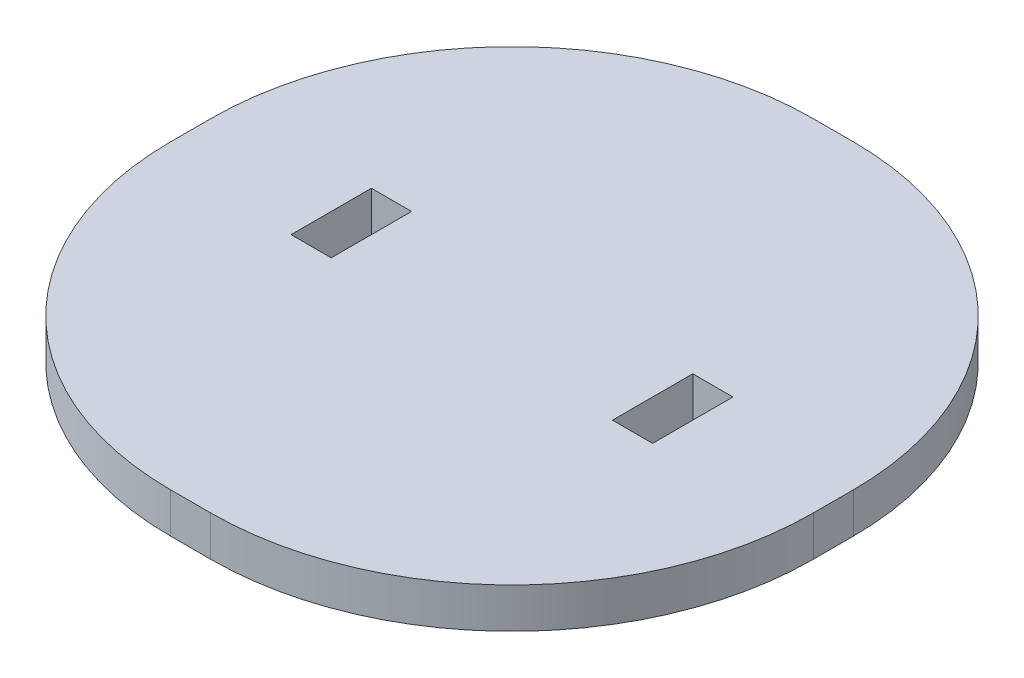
ISO-10303-21;
HEADER;
FILE_DESCRIPTION(('STEP AP214'),'2;1');
FILE_NAME('part.step','',(''),(''),'','','');
FILE_SCHEMA(('AUTOMOTIVE_DESIGN { 1 0 10303 214 1 1 1 1 }'));
ENDSEC;
DATA;
#1=APPLICATION_CONTEXT('core data for automotive mechanical design processes');
#2=APPLICATION_PROTOCOL_DEFINITION('international standard','automotive_design',2000,#1);
#3=PRODUCT_CONTEXT('',#1,'mechanical');
#4=PRODUCT('Part','Part','',(#3));
#5=PRODUCT_RELATED_PRODUCT_CATEGORY('part','',(#4));
#6=PRODUCT_DEFINITION_FORMATION('','',#4);
#7=PRODUCT_DEFINITION_CONTEXT('part definition',#1,'design');
#8=PRODUCT_DEFINITION('design','',#6,#7);
#9=PRODUCT_DEFINITION_SHAPE('','',#8);
#10=(LENGTH_UNIT() NAMED_UNIT(*) SI_UNIT(.MILLI.,.METRE.));
#11=(NAMED_UNIT(*) PLANE_ANGLE_UNIT() SI_UNIT($,.RADIAN.));
#12=(NAMED_UNIT(*) SI_UNIT($,.STERADIAN.) SOLID_ANGLE_UNIT());
#13=UNCERTAINTY_MEASURE_WITH_UNIT(LENGTH_MEASURE(1.E-05),#10,'distance_accuracy_value','');
#14=(GEOMETRIC_REPRESENTATION_CONTEXT(3) GLOBAL_UNCERTAINTY_ASSIGNED_CONTEXT((#13)) GLOBAL_UNIT_ASSIGNED_CONTEXT((#10,
#11,#12)) REPRESENTATION_CONTEXT('',''));
#15=CARTESIAN_POINT('',(0.,0.,0.));
#16=DIRECTION('',(0.,0.,1.));
#17=DIRECTION('',(1.,0.,0.));
#18=AXIS2_PLACEMENT_3D('',#15,#16,#17);
#19=CARTESIAN_POINT('',(25.4,1.5875,-25.4));
#20=DIRECTION('',(-1.,0.,0.));
#21=DIRECTION('',(0.,0.,1.));
#22=AXIS2_PLACEMENT_3D('',#19,#20,#21);
#23=PLANE('',#22);
#24=DIRECTION('',(0.,0.,-1.));
#25=VECTOR('',#24,1.);
#26=CARTESIAN_POINT('',(25.4,-1.5875,-25.4));
#27=LINE('',#26,#25);
#28=CARTESIAN_POINT('',(25.4,-1.5875,1.5875));
#29=VERTEX_POINT('',#28);
#30=CARTESIAN_POINT('',(25.4,-1.5875,-1.5875));
#31=VERTEX_POINT('',#30);
#32=EDGE_CURVE('E214',#29,#31,#27,.T.);
#33=ORIENTED_EDGE('',*,*,#32,.T.);
#34=DIRECTION('',(0.,-1.,0.));
#35=VECTOR('',#34,1.);
#36=CARTESIAN_POINT('',(25.4,1.5875,-1.5875));
#37=LINE('',#36,#35);
#38=CARTESIAN_POINT('',(25.4,1.5875,-1.5875));
#39=VERTEX_POINT('',#38);
#40=EDGE_CURVE('E257',#31,#39,#37,.F.);
#41=ORIENTED_EDGE('',*,*,#40,.T.);
#42=DIRECTION('',(0.,0.,-1.));
#43=VECTOR('',#42,1.);
#44=CARTESIAN_POINT('',(25.4,1.5875,-25.4));
#45=LINE('',#44,#43);
#46=CARTESIAN_POINT('',(25.4,1.5875,1.5875));
#47=VERTEX_POINT('',#46);
#48=EDGE_CURVE('E221',#47,#39,#45,.T.);
#49=ORIENTED_EDGE('',*,*,#48,.F.);
#50=DIRECTION('',(0.,-1.,0.));
#51=VECTOR('',#50,1.);
#52=CARTESIAN_POINT('',(25.4,1.5875,1.5875));
#53=LINE('',#52,#51);
#54=EDGE_CURVE('E254',#47,#29,#53,.T.);
#55=ORIENTED_EDGE('',*,*,#54,.T.);
#56=EDGE_LOOP('',(#33,#41,#49,#55));
#57=FACE_BOUND('',#56,.T.);
#58=ADVANCED_FACE('F31',(#57),#23,.F.);
#59=CARTESIAN_POINT('',(-25.4,1.5875,-25.4));
#60=DIRECTION('',(0.,0.,1.));
#61=DIRECTION('',(1.,0.,0.));
#62=AXIS2_PLACEMENT_3D('',#59,#60,#61);
#63=PLANE('',#62);
#64=DIRECTION('',(-1.,0.,0.));
#65=VECTOR('',#64,1.);
#66=CARTESIAN_POINT('',(-25.4,1.5875,-25.4));
#67=LINE('',#66,#65);
#68=CARTESIAN_POINT('',(1.5875,1.5875,-25.4));
#69=VERTEX_POINT('',#68);
#70=CARTESIAN_POINT('',(-1.5875,1.5875,-25.4));
#71=VERTEX_POINT('',#70);
#72=EDGE_CURVE('E224',#69,#71,#67,.T.);
#73=ORIENTED_EDGE('',*,*,#72,.F.);
#74=DIRECTION('',(0.,-1.,0.));
#75=VECTOR('',#74,1.);
#76=CARTESIAN_POINT('',(1.5875,1.5875,-25.4));
#77=LINE('',#76,#75);
#78=CARTESIAN_POINT('',(1.5875,-1.5875,-25.4));
#79=VERTEX_POINT('',#78);
#80=EDGE_CURVE('E243',#69,#79,#77,.T.);
#81=ORIENTED_EDGE('',*,*,#80,.T.);
#82=DIRECTION('',(-1.,0.,0.));
#83=VECTOR('',#82,1.);
#84=CARTESIAN_POINT('',(-25.4,-1.5875,-25.4));
#85=LINE('',#84,#83);
#86=CARTESIAN_POINT('',(-1.5875,-1.5875,-25.4));
#87=VERTEX_POINT('',#86);
#88=EDGE_CURVE('E235',#79,#87,#85,.T.);
#89=ORIENTED_EDGE('',*,*,#88,.T.);
#90=DIRECTION('',(0.,-1.,0.));
#91=VECTOR('',#90,1.);
#92=CARTESIAN_POINT('',(-1.5875,1.5875,-25.4));
#93=LINE('',#92,#91);
#94=EDGE_CURVE('E232',#87,#71,#93,.F.);
#95=ORIENTED_EDGE('',*,*,#94,.T.);
#96=EDGE_LOOP('',(#73,#81,#89,#95));
#97=FACE_BOUND('',#96,.T.);
#98=ADVANCED_FACE('F300',(#97),#63,.F.);
#99=CARTESIAN_POINT('',(-25.4,1.5875,-25.4));
#100=DIRECTION('',(1.,0.,0.));
#101=DIRECTION('',(0.,0.,-1.));
#102=AXIS2_PLACEMENT_3D('',#99,#100,#101);
#103=PLANE('',#102);
#104=DIRECTION('',(0.,0.,1.));
#105=VECTOR('',#104,1.);
#106=CARTESIAN_POINT('',(-25.4,-1.5875,-25.4));
#107=LINE('',#106,#105);
#108=CARTESIAN_POINT('',(-25.4,-1.5875,-1.5875));
#109=VERTEX_POINT('',#108);
#110=CARTESIAN_POINT('',(-25.4,-1.5875,1.5875));
#111=VERTEX_POINT('',#110);
#112=EDGE_CURVE('E238',#109,#111,#107,.T.);
#113=ORIENTED_EDGE('',*,*,#112,.T.);
#114=DIRECTION('',(0.,-1.,0.));
#115=VECTOR('',#114,1.);
#116=CARTESIAN_POINT('',(-25.4,1.5875,1.5875));
#117=LINE('',#116,#115);
#118=CARTESIAN_POINT('',(-25.4,1.5875,1.5875));
#119=VERTEX_POINT('',#118);
#120=EDGE_CURVE('E11',#111,#119,#117,.F.);
#121=ORIENTED_EDGE('',*,*,#120,.T.);
#122=DIRECTION('',(0.,0.,1.));
#123=VECTOR('',#122,1.);
#124=CARTESIAN_POINT('',(-25.4,1.5875,-25.4));
#125=LINE('',#124,#123);
#126=CARTESIAN_POINT('',(-25.4,1.5875,-1.5875));
#127=VERTEX_POINT('',#126);
#128=EDGE_CURVE('E228',#127,#119,#125,.T.);
#129=ORIENTED_EDGE('',*,*,#128,.F.);
#130=DIRECTION('',(0.,-1.,0.));
#131=VECTOR('',#130,1.);
#132=CARTESIAN_POINT('',(-25.4,1.5875,-1.5875));
#133=LINE('',#132,#131);
#134=EDGE_CURVE('E39',#127,#109,#133,.T.);
#135=ORIENTED_EDGE('',*,*,#134,.T.);
#136=EDGE_LOOP('',(#113,#121,#129,#135));
#137=FACE_BOUND('',#136,.T.);
#138=ADVANCED_FACE('F274',(#137),#103,.F.);
#139=CARTESIAN_POINT('',(-25.4,1.5875,25.4));
#140=DIRECTION('',(0.,0.,-1.));
#141=DIRECTION('',(-1.,0.,0.));
#142=AXIS2_PLACEMENT_3D('',#139,#140,#141);
#143=PLANE('',#142);
#144=DIRECTION('',(1.,0.,0.));
#145=VECTOR('',#144,1.);
#146=CARTESIAN_POINT('',(-25.4,-1.5875,25.4));
#147=LINE('',#146,#145);
#148=CARTESIAN_POINT('',(-1.5875,-1.5875,25.4));
#149=VERTEX_POINT('',#148);
#150=CARTESIAN_POINT('',(1.5875,-1.5875,25.4));
#151=VERTEX_POINT('',#150);
#152=EDGE_CURVE('E225',#149,#151,#147,.T.);
#153=ORIENTED_EDGE('',*,*,#152,.T.);
#154=DIRECTION('',(0.,-1.,0.));
#155=VECTOR('',#154,1.);
#156=CARTESIAN_POINT('',(1.5875,1.5875,25.4));
#157=LINE('',#156,#155);
#158=CARTESIAN_POINT('',(1.5875,1.5875,25.4));
#159=VERTEX_POINT('',#158);
#160=EDGE_CURVE('E46',#151,#159,#157,.F.);
#161=ORIENTED_EDGE('',*,*,#160,.T.);
#162=DIRECTION('',(1.,0.,0.));
#163=VECTOR('',#162,1.);
#164=CARTESIAN_POINT('',(-25.4,1.5875,25.4));
#165=LINE('',#164,#163);
#166=CARTESIAN_POINT('',(-1.5875,1.5875,25.4));
#167=VERTEX_POINT('',#166);
#168=EDGE_CURVE('E230',#167,#159,#165,.T.);
#169=ORIENTED_EDGE('',*,*,#168,.F.);
#170=DIRECTION('',(0.,-1.,0.));
#171=VECTOR('',#170,1.);
#172=CARTESIAN_POINT('',(-1.5875,1.5875,25.4));
#173=LINE('',#172,#171);
#174=EDGE_CURVE('E266',#167,#149,#173,.T.);
#175=ORIENTED_EDGE('',*,*,#174,.T.);
#176=EDGE_LOOP('',(#153,#161,#169,#175));
#177=FACE_BOUND('',#176,.T.);
#178=ADVANCED_FACE('F284',(#177),#143,.F.);
#179=CARTESIAN_POINT('',(25.4,1.5875,25.4));
#180=DIRECTION('',(0.,1.,0.));
#181=DIRECTION('',(0.,0.,1.));
#182=AXIS2_PLACEMENT_3D('',#179,#180,#181);
#183=PLANE('',#182);
#184=DIRECTION('',(0.,0.,-1.));
#185=VECTOR('',#184,1.);
#186=CARTESIAN_POINT('',(14.2875,1.5875,-3.17499999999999));
#187=LINE('',#186,#185);
#188=CARTESIAN_POINT('',(14.2875,1.5875,3.17500000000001));
#189=VERTEX_POINT('',#188);
#190=CARTESIAN_POINT('',(14.2875,1.5875,-3.17499999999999));
#191=VERTEX_POINT('',#190);
#192=EDGE_CURVE('E152',#189,#191,#187,.T.);
#193=ORIENTED_EDGE('',*,*,#192,.F.);
#194=DIRECTION('',(1.,0.,0.));
#195=VECTOR('',#194,1.);
#196=CARTESIAN_POINT('',(14.2875,1.5875,3.17500000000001));
#197=LINE('',#196,#195);
#198=CARTESIAN_POINT('',(11.1125,1.5875,3.17500000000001));
#199=VERTEX_POINT('',#198);
#200=EDGE_CURVE('E170',#199,#189,#197,.T.);
#201=ORIENTED_EDGE('',*,*,#200,.F.);
#202=DIRECTION('',(0.,0.,1.));
#203=VECTOR('',#202,1.);
#204=CARTESIAN_POINT('',(11.1125,1.5875,-3.17499999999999));
#205=LINE('',#204,#203);
#206=CARTESIAN_POINT('',(11.1125,1.5875,-3.17499999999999));
#207=VERTEX_POINT('',#206);
#208=EDGE_CURVE('E173',#207,#199,#205,.T.);
#209=ORIENTED_EDGE('',*,*,#208,.F.);
#210=DIRECTION('',(-1.,0.,0.));
#211=VECTOR('',#210,1.);
#212=CARTESIAN_POINT('',(14.2875,1.5875,-3.17499999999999));
#213=LINE('',#212,#211);
#214=EDGE_CURVE('E179',#191,#207,#213,.T.);
#215=ORIENTED_EDGE('',*,*,#214,.F.);
#216=EDGE_LOOP('',(#193,#201,#209,#215));
#217=FACE_BOUND('',#216,.T.);
#218=DIRECTION('',(0.,0.,-1.));
#219=VECTOR('',#218,1.);
#220=CARTESIAN_POINT('',(-11.1125,1.5875,-3.17499999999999));
#221=LINE('',#220,#219);
#222=CARTESIAN_POINT('',(-11.1125,1.5875,3.17500000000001));
#223=VERTEX_POINT('',#222);
#224=CARTESIAN_POINT('',(-11.1125,1.5875,-3.17499999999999));
#225=VERTEX_POINT('',#224);
#226=EDGE_CURVE('E185',#223,#225,#221,.T.);
#227=ORIENTED_EDGE('',*,*,#226,.F.);
#228=DIRECTION('',(1.,0.,0.));
#229=VECTOR('',#228,1.);
#230=CARTESIAN_POINT('',(-14.2875,1.5875,3.17500000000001));
#231=LINE('',#230,#229);
#232=CARTESIAN_POINT('',(-14.2875,1.5875,3.17500000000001));
#233=VERTEX_POINT('',#232);
#234=EDGE_CURVE('E193',#233,#223,#231,.T.);
#235=ORIENTED_EDGE('',*,*,#234,.F.);
#236=DIRECTION('',(0.,0.,1.));
#237=VECTOR('',#236,1.);
#238=CARTESIAN_POINT('',(-14.2875,1.5875,-3.17499999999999));
#239=LINE('',#238,#237);
#240=CARTESIAN_POINT('',(-14.2875,1.5875,-3.17499999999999));
#241=VERTEX_POINT('',#240);
#242=EDGE_CURVE('E207',#241,#233,#239,.T.);
#243=ORIENTED_EDGE('',*,*,#242,.F.);
#244=DIRECTION('',(-1.,0.,0.));
#245=VECTOR('',#244,1.);
#246=CARTESIAN_POINT('',(-14.2875,1.5875,-3.17499999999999));
#247=LINE('',#246,#245);
#248=EDGE_CURVE('E204',#225,#241,#247,.T.);
#249=ORIENTED_EDGE('',*,*,#248,.F.);
#250=EDGE_LOOP('',(#227,#235,#243,#249));
#251=FACE_BOUND('',#250,.T.);
#252=ORIENTED_EDGE('',*,*,#48,.T.);
#253=CARTESIAN_POINT('',(1.5875,1.5875,-1.5875));
#254=DIRECTION('',(0.,1.,0.));
#255=DIRECTION('',(0.,0.,1.));
#256=AXIS2_PLACEMENT_3D('',#253,#254,#255);
#257=CIRCLE('',#256,23.8125);
#258=EDGE_CURVE('E264',#39,#69,#257,.T.);
#259=ORIENTED_EDGE('',*,*,#258,.T.);
#260=ORIENTED_EDGE('',*,*,#72,.T.);
#261=CARTESIAN_POINT('',(-1.5875,1.5875,-1.5875));
#262=DIRECTION('',(0.,1.,0.));
#263=DIRECTION('',(0.,0.,1.));
#264=AXIS2_PLACEMENT_3D('',#261,#262,#263);
#265=CIRCLE('',#264,23.8125);
#266=EDGE_CURVE('E259',#71,#127,#265,.T.);
#267=ORIENTED_EDGE('',*,*,#266,.T.);
#268=ORIENTED_EDGE('',*,*,#128,.T.);
#269=CARTESIAN_POINT('',(-1.5875,1.5875,1.5875));
#270=DIRECTION('',(0.,1.,0.));
#271=DIRECTION('',(0.,0.,1.));
#272=AXIS2_PLACEMENT_3D('',#269,#270,#271);
#273=CIRCLE('',#272,23.8125);
#274=EDGE_CURVE('E53',#119,#167,#273,.T.);
#275=ORIENTED_EDGE('',*,*,#274,.T.);
#276=ORIENTED_EDGE('',*,*,#168,.T.);
#277=CARTESIAN_POINT('',(1.5875,1.5875,1.5875));
#278=DIRECTION('',(0.,1.,0.));
#279=DIRECTION('',(0.,0.,1.));
#280=AXIS2_PLACEMENT_3D('',#277,#278,#279);
#281=CIRCLE('',#280,23.8125);
#282=EDGE_CURVE('E262',#159,#47,#281,.T.);
#283=ORIENTED_EDGE('',*,*,#282,.T.);
#284=EDGE_LOOP('',(#252,#259,#260,#267,#268,#275,#276,#283));
#285=FACE_BOUND('',#284,.T.);
#286=ADVANCED_FACE('F286',(#217,#251,#285),#183,.T.);
#287=CARTESIAN_POINT('',(25.4,-1.5875,25.4));
#288=DIRECTION('',(0.,1.,0.));
#289=DIRECTION('',(0.,0.,1.));
#290=AXIS2_PLACEMENT_3D('',#287,#288,#289);
#291=PLANE('',#290);
#292=DIRECTION('',(1.,0.,0.));
#293=VECTOR('',#292,1.);
#294=CARTESIAN_POINT('',(14.2875,-1.5875,3.17500000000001));
#295=LINE('',#294,#293);
#296=CARTESIAN_POINT('',(11.1125,-1.5875,3.17500000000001));
#297=VERTEX_POINT('',#296);
#298=CARTESIAN_POINT('',(14.2875,-1.5875,3.17500000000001));
#299=VERTEX_POINT('',#298);
#300=EDGE_CURVE('E157',#297,#299,#295,.T.);
#301=ORIENTED_EDGE('',*,*,#300,.T.);
#302=DIRECTION('',(0.,0.,-1.));
#303=VECTOR('',#302,1.);
#304=CARTESIAN_POINT('',(14.2875,-1.5875,-3.17499999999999));
#305=LINE('',#304,#303);
#306=CARTESIAN_POINT('',(14.2875,-1.5875,-3.17499999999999));
#307=VERTEX_POINT('',#306);
#308=EDGE_CURVE('E149',#299,#307,#305,.T.);
#309=ORIENTED_EDGE('',*,*,#308,.T.);
#310=DIRECTION('',(-1.,0.,0.));
#311=VECTOR('',#310,1.);
#312=CARTESIAN_POINT('',(14.2875,-1.5875,-3.17499999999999));
#313=LINE('',#312,#311);
#314=CARTESIAN_POINT('',(11.1125,-1.5875,-3.17499999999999));
#315=VERTEX_POINT('',#314);
#316=EDGE_CURVE('E161',#307,#315,#313,.T.);
#317=ORIENTED_EDGE('',*,*,#316,.T.);
#318=DIRECTION('',(0.,0.,1.));
#319=VECTOR('',#318,1.);
#320=CARTESIAN_POINT('',(11.1125,-1.5875,-3.17499999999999));
#321=LINE('',#320,#319);
#322=EDGE_CURVE('E165',#315,#297,#321,.T.);
#323=ORIENTED_EDGE('',*,*,#322,.T.);
#324=EDGE_LOOP('',(#301,#309,#317,#323));
#325=FACE_BOUND('',#324,.T.);
#326=DIRECTION('',(1.,0.,0.));
#327=VECTOR('',#326,1.);
#328=CARTESIAN_POINT('',(-14.2875,-1.5875,3.17500000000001));
#329=LINE('',#328,#327);
#330=CARTESIAN_POINT('',(-14.2875,-1.5875,3.17500000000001));
#331=VERTEX_POINT('',#330);
#332=CARTESIAN_POINT('',(-11.1125,-1.5875,3.17500000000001));
#333=VERTEX_POINT('',#332);
#334=EDGE_CURVE('E199',#331,#333,#329,.T.);
#335=ORIENTED_EDGE('',*,*,#334,.T.);
#336=DIRECTION('',(0.,0.,-1.));
#337=VECTOR('',#336,1.);
#338=CARTESIAN_POINT('',(-11.1125,-1.5875,-3.17499999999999));
#339=LINE('',#338,#337);
#340=CARTESIAN_POINT('',(-11.1125,-1.5875,-3.17499999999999));
#341=VERTEX_POINT('',#340);
#342=EDGE_CURVE('E189',#333,#341,#339,.T.);
#343=ORIENTED_EDGE('',*,*,#342,.T.);
#344=DIRECTION('',(-1.,0.,0.));
#345=VECTOR('',#344,1.);
#346=CARTESIAN_POINT('',(-14.2875,-1.5875,-3.17499999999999));
#347=LINE('',#346,#345);
#348=CARTESIAN_POINT('',(-14.2875,-1.5875,-3.17499999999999));
#349=VERTEX_POINT('',#348);
#350=EDGE_CURVE('E192',#341,#349,#347,.T.);
#351=ORIENTED_EDGE('',*,*,#350,.T.);
#352=DIRECTION('',(0.,0.,1.));
#353=VECTOR('',#352,1.);
#354=CARTESIAN_POINT('',(-14.2875,-1.5875,-3.17499999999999));
#355=LINE('',#354,#353);
#356=EDGE_CURVE('E196',#349,#331,#355,.T.);
#357=ORIENTED_EDGE('',*,*,#356,.T.);
#358=EDGE_LOOP('',(#335,#343,#351,#357));
#359=FACE_BOUND('',#358,.T.);
#360=ORIENTED_EDGE('',*,*,#88,.F.);
#361=CARTESIAN_POINT('',(1.5875,-1.5875,-1.5875));
#362=DIRECTION('',(0.,1.,0.));
#363=DIRECTION('',(0.,0.,1.));
#364=AXIS2_PLACEMENT_3D('',#361,#362,#363);
#365=CIRCLE('',#364,23.8125);
#366=EDGE_CURVE('E252',#79,#31,#365,.F.);
#367=ORIENTED_EDGE('',*,*,#366,.T.);
#368=ORIENTED_EDGE('',*,*,#32,.F.);
#369=CARTESIAN_POINT('',(1.5875,-1.5875,1.5875));
#370=DIRECTION('',(0.,1.,0.));
#371=DIRECTION('',(0.,0.,1.));
#372=AXIS2_PLACEMENT_3D('',#369,#370,#371);
#373=CIRCLE('',#372,23.8125);
#374=EDGE_CURVE('E250',#29,#151,#373,.F.);
#375=ORIENTED_EDGE('',*,*,#374,.T.);
#376=ORIENTED_EDGE('',*,*,#152,.F.);
#377=CARTESIAN_POINT('',(-1.5875,-1.5875,1.5875));
#378=DIRECTION('',(0.,1.,0.));
#379=DIRECTION('',(0.,0.,1.));
#380=AXIS2_PLACEMENT_3D('',#377,#378,#379);
#381=CIRCLE('',#380,23.8125);
#382=EDGE_CURVE('E248',#149,#111,#381,.F.);
#383=ORIENTED_EDGE('',*,*,#382,.T.);
#384=ORIENTED_EDGE('',*,*,#112,.F.);
#385=CARTESIAN_POINT('',(-1.5875,-1.5875,-1.5875));
#386=DIRECTION('',(0.,1.,0.));
#387=DIRECTION('',(0.,0.,1.));
#388=AXIS2_PLACEMENT_3D('',#385,#386,#387);
#389=CIRCLE('',#388,23.8125);
#390=EDGE_CURVE('E246',#109,#87,#389,.F.);
#391=ORIENTED_EDGE('',*,*,#390,.T.);
#392=EDGE_LOOP('',(#360,#367,#368,#375,#376,#383,#384,#391));
#393=FACE_BOUND('',#392,.T.);
#394=ADVANCED_FACE('F167',(#325,#359,#393),#291,.F.);
#395=CARTESIAN_POINT('',(-11.1125,-1.5875,-3.17499999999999));
#396=DIRECTION('',(1.,0.,0.));
#397=DIRECTION('',(0.,0.,-1.));
#398=AXIS2_PLACEMENT_3D('',#395,#396,#397);
#399=PLANE('',#398);
#400=ORIENTED_EDGE('',*,*,#226,.T.);
#401=DIRECTION('',(0.,1.,0.));
#402=VECTOR('',#401,1.);
#403=CARTESIAN_POINT('',(-11.1125,-1.5875,-3.17499999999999));
#404=LINE('',#403,#402);
#405=EDGE_CURVE('E202',#341,#225,#404,.T.);
#406=ORIENTED_EDGE('',*,*,#405,.F.);
#407=ORIENTED_EDGE('',*,*,#342,.F.);
#408=DIRECTION('',(0.,1.,0.));
#409=VECTOR('',#408,1.);
#410=CARTESIAN_POINT('',(-11.1125,-1.5875,3.17500000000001));
#411=LINE('',#410,#409);
#412=EDGE_CURVE('E212',#333,#223,#411,.T.);
#413=ORIENTED_EDGE('',*,*,#412,.T.);
#414=EDGE_LOOP('',(#400,#406,#407,#413));
#415=FACE_BOUND('',#414,.T.);
#416=ADVANCED_FACE('F397',(#415),#399,.F.);
#417=CARTESIAN_POINT('',(-14.2875,-1.5875,3.17500000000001));
#418=DIRECTION('',(0.,0.,1.));
#419=DIRECTION('',(1.,0.,0.));
#420=AXIS2_PLACEMENT_3D('',#417,#418,#419);
#421=PLANE('',#420);
#422=ORIENTED_EDGE('',*,*,#234,.T.);
#423=ORIENTED_EDGE('',*,*,#412,.F.);
#424=ORIENTED_EDGE('',*,*,#334,.F.);
#425=DIRECTION('',(0.,1.,0.));
#426=VECTOR('',#425,1.);
#427=CARTESIAN_POINT('',(-14.2875,-1.5875,3.17500000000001));
#428=LINE('',#427,#426);
#429=EDGE_CURVE('E215',#331,#233,#428,.T.);
#430=ORIENTED_EDGE('',*,*,#429,.T.);
#431=EDGE_LOOP('',(#422,#423,#424,#430));
#432=FACE_BOUND('',#431,.T.);
#433=ADVANCED_FACE('F388',(#432),#421,.F.);
#434=CARTESIAN_POINT('',(-14.2875,-1.5875,-3.17499999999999));
#435=DIRECTION('',(-1.,0.,0.));
#436=DIRECTION('',(0.,0.,1.));
#437=AXIS2_PLACEMENT_3D('',#434,#435,#436);
#438=PLANE('',#437);
#439=ORIENTED_EDGE('',*,*,#242,.T.);
#440=ORIENTED_EDGE('',*,*,#429,.F.);
#441=ORIENTED_EDGE('',*,*,#356,.F.);
#442=DIRECTION('',(0.,1.,0.));
#443=VECTOR('',#442,1.);
#444=CARTESIAN_POINT('',(-14.2875,-1.5875,-3.17499999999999));
#445=LINE('',#444,#443);
#446=EDGE_CURVE('E217',#349,#241,#445,.T.);
#447=ORIENTED_EDGE('',*,*,#446,.T.);
#448=EDGE_LOOP('',(#439,#440,#441,#447));
#449=FACE_BOUND('',#448,.T.);
#450=ADVANCED_FACE('F379',(#449),#438,.F.);
#451=CARTESIAN_POINT('',(-14.2875,-1.5875,-3.17499999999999));
#452=DIRECTION('',(0.,0.,-1.));
#453=DIRECTION('',(-1.,0.,0.));
#454=AXIS2_PLACEMENT_3D('',#451,#452,#453);
#455=PLANE('',#454);
#456=ORIENTED_EDGE('',*,*,#248,.T.);
#457=ORIENTED_EDGE('',*,*,#446,.F.);
#458=ORIENTED_EDGE('',*,*,#350,.F.);
#459=ORIENTED_EDGE('',*,*,#405,.T.);
#460=EDGE_LOOP('',(#456,#457,#458,#459));
#461=FACE_BOUND('',#460,.T.);
#462=ADVANCED_FACE('F371',(#461),#455,.F.);
#463=CARTESIAN_POINT('',(14.2875,-1.5875,-3.17499999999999));
#464=DIRECTION('',(1.,0.,0.));
#465=DIRECTION('',(0.,0.,-1.));
#466=AXIS2_PLACEMENT_3D('',#463,#464,#465);
#467=PLANE('',#466);
#468=ORIENTED_EDGE('',*,*,#192,.T.);
#469=DIRECTION('',(0.,1.,0.));
#470=VECTOR('',#469,1.);
#471=CARTESIAN_POINT('',(14.2875,-1.5875,-3.17499999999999));
#472=LINE('',#471,#470);
#473=EDGE_CURVE('E145',#307,#191,#472,.T.);
#474=ORIENTED_EDGE('',*,*,#473,.F.);
#475=ORIENTED_EDGE('',*,*,#308,.F.);
#476=DIRECTION('',(0.,1.,0.));
#477=VECTOR('',#476,1.);
#478=CARTESIAN_POINT('',(14.2875,-1.5875,3.17500000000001));
#479=LINE('',#478,#477);
#480=EDGE_CURVE('E183',#299,#189,#479,.T.);
#481=ORIENTED_EDGE('',*,*,#480,.T.);
#482=EDGE_LOOP('',(#468,#474,#475,#481));
#483=FACE_BOUND('',#482,.T.);
#484=ADVANCED_FACE('F147',(#483),#467,.F.);
#485=CARTESIAN_POINT('',(14.2875,-1.5875,3.17500000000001));
#486=DIRECTION('',(0.,0.,1.));
#487=DIRECTION('',(1.,0.,0.));
#488=AXIS2_PLACEMENT_3D('',#485,#486,#487);
#489=PLANE('',#488);
#490=ORIENTED_EDGE('',*,*,#200,.T.);
#491=ORIENTED_EDGE('',*,*,#480,.F.);
#492=ORIENTED_EDGE('',*,*,#300,.F.);
#493=DIRECTION('',(0.,1.,0.));
#494=VECTOR('',#493,1.);
#495=CARTESIAN_POINT('',(11.1125,-1.5875,3.17500000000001));
#496=LINE('',#495,#494);
#497=EDGE_CURVE('E186',#297,#199,#496,.T.);
#498=ORIENTED_EDGE('',*,*,#497,.T.);
#499=EDGE_LOOP('',(#490,#491,#492,#498));
#500=FACE_BOUND('',#499,.T.);
#501=ADVANCED_FACE('F354',(#500),#489,.F.);
#502=CARTESIAN_POINT('',(11.1125,-1.5875,-3.17499999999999));
#503=DIRECTION('',(-1.,0.,0.));
#504=DIRECTION('',(0.,0.,1.));
#505=AXIS2_PLACEMENT_3D('',#502,#503,#504);
#506=PLANE('',#505);
#507=ORIENTED_EDGE('',*,*,#208,.T.);
#508=ORIENTED_EDGE('',*,*,#497,.F.);
#509=ORIENTED_EDGE('',*,*,#322,.F.);
#510=DIRECTION('',(0.,1.,0.));
#511=VECTOR('',#510,1.);
#512=CARTESIAN_POINT('',(11.1125,-1.5875,-3.17499999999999));
#513=LINE('',#512,#511);
#514=EDGE_CURVE('E156',#315,#207,#513,.T.);
#515=ORIENTED_EDGE('',*,*,#514,.T.);
#516=EDGE_LOOP('',(#507,#508,#509,#515));
#517=FACE_BOUND('',#516,.T.);
#518=ADVANCED_FACE('F346',(#517),#506,.F.);
#519=CARTESIAN_POINT('',(14.2875,-1.5875,-3.17499999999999));
#520=DIRECTION('',(0.,0.,-1.));
#521=DIRECTION('',(-1.,0.,0.));
#522=AXIS2_PLACEMENT_3D('',#519,#520,#521);
#523=PLANE('',#522);
#524=ORIENTED_EDGE('',*,*,#214,.T.);
#525=ORIENTED_EDGE('',*,*,#514,.F.);
#526=ORIENTED_EDGE('',*,*,#316,.F.);
#527=ORIENTED_EDGE('',*,*,#473,.T.);
#528=EDGE_LOOP('',(#524,#525,#526,#527));
#529=FACE_BOUND('',#528,.T.);
#530=ADVANCED_FACE('F162',(#529),#523,.F.);
#531=CARTESIAN_POINT('',(1.5875,1.5875,-1.5875));
#532=DIRECTION('',(0.,-1.,0.));
#533=DIRECTION('',(0.,0.,-1.));
#534=AXIS2_PLACEMENT_3D('',#531,#532,#533);
#535=CYLINDRICAL_SURFACE('',#534,23.8125);
#536=ORIENTED_EDGE('',*,*,#258,.F.);
#537=ORIENTED_EDGE('',*,*,#40,.F.);
#538=ORIENTED_EDGE('',*,*,#366,.F.);
#539=ORIENTED_EDGE('',*,*,#80,.F.);
#540=EDGE_LOOP('',(#536,#537,#538,#539));
#541=FACE_BOUND('',#540,.T.);
#542=ADVANCED_FACE('F297',(#541),#535,.T.);
#543=CARTESIAN_POINT('',(1.5875,1.5875,1.5875));
#544=DIRECTION('',(0.,-1.,0.));
#545=DIRECTION('',(0.,0.,-1.));
#546=AXIS2_PLACEMENT_3D('',#543,#544,#545);
#547=CYLINDRICAL_SURFACE('',#546,23.8125);
#548=ORIENTED_EDGE('',*,*,#282,.F.);
#549=ORIENTED_EDGE('',*,*,#160,.F.);
#550=ORIENTED_EDGE('',*,*,#374,.F.);
#551=ORIENTED_EDGE('',*,*,#54,.F.);
#552=EDGE_LOOP('',(#548,#549,#550,#551));
#553=FACE_BOUND('',#552,.T.);
#554=ADVANCED_FACE('F290',(#553),#547,.T.);
#555=CARTESIAN_POINT('',(-1.5875,1.5875,1.5875));
#556=DIRECTION('',(0.,-1.,0.));
#557=DIRECTION('',(0.,0.,-1.));
#558=AXIS2_PLACEMENT_3D('',#555,#556,#557);
#559=CYLINDRICAL_SURFACE('',#558,23.8125);
#560=ORIENTED_EDGE('',*,*,#274,.F.);
#561=ORIENTED_EDGE('',*,*,#120,.F.);
#562=ORIENTED_EDGE('',*,*,#382,.F.);
#563=ORIENTED_EDGE('',*,*,#174,.F.);
#564=EDGE_LOOP('',(#560,#561,#562,#563));
#565=FACE_BOUND('',#564,.T.);
#566=ADVANCED_FACE('F283',(#565),#559,.T.);
#567=CARTESIAN_POINT('',(-1.5875,1.5875,-1.5875));
#568=DIRECTION('',(0.,-1.,0.));
#569=DIRECTION('',(0.,0.,-1.));
#570=AXIS2_PLACEMENT_3D('',#567,#568,#569);
#571=CYLINDRICAL_SURFACE('',#570,23.8125);
#572=ORIENTED_EDGE('',*,*,#266,.F.);
#573=ORIENTED_EDGE('',*,*,#94,.F.);
#574=ORIENTED_EDGE('',*,*,#390,.F.);
#575=ORIENTED_EDGE('',*,*,#134,.F.);
#576=EDGE_LOOP('',(#572,#573,#574,#575));
#577=FACE_BOUND('',#576,.T.);
#578=ADVANCED_FACE('F33',(#577),#571,.T.);
#579=CLOSED_SHELL('',(#58,#98,#138,#178,#286,#394,#416,#433,#450,#462,#484,#501,#518,#530,#542,
#554,#566,#578));
#580=MANIFOLD_SOLID_BREP('B2',#579);
#581=ADVANCED_BREP_SHAPE_REPRESENTATION('',(#18,#580),#14);
#582=SHAPE_DEFINITION_REPRESENTATION(#9,#581);
ENDSEC;
END-ISO-10303-21;
